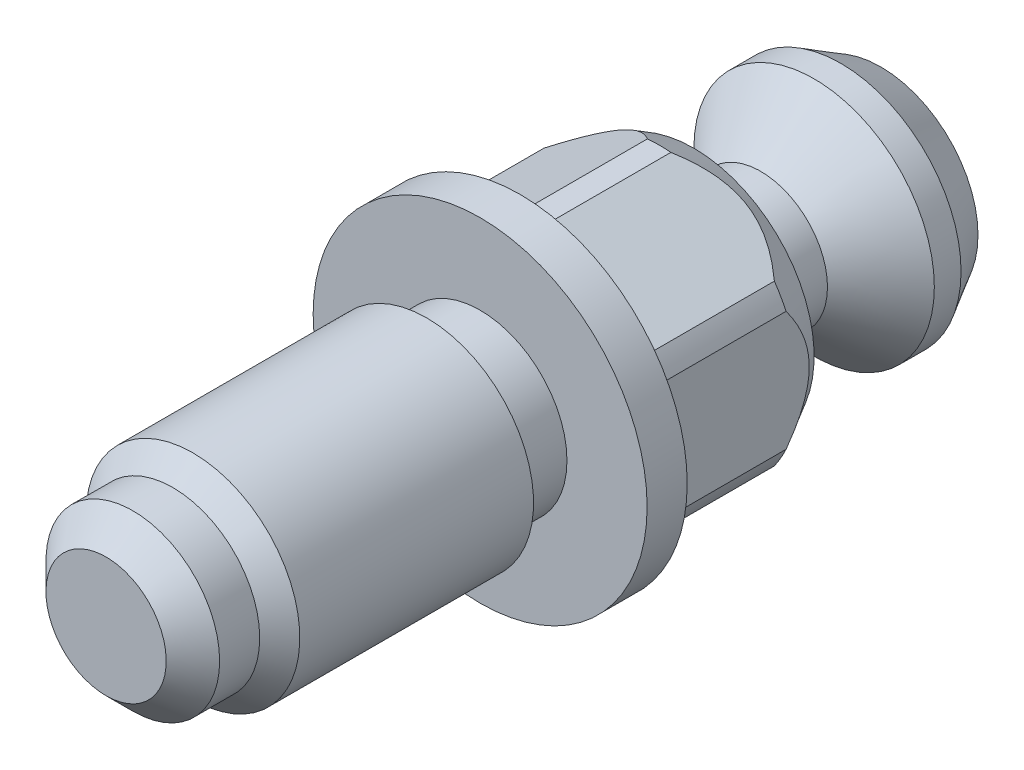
ISO-10303-21;
HEADER;
FILE_DESCRIPTION(('STEP AP214'),'2;1');
FILE_NAME('part.step','',(''),(''),'','','');
FILE_SCHEMA(('AUTOMOTIVE_DESIGN { 1 0 10303 214 1 1 1 1 }'));
ENDSEC;
DATA;
#1=APPLICATION_CONTEXT('core data for automotive mechanical design processes');
#2=APPLICATION_PROTOCOL_DEFINITION('international standard','automotive_design',2000,#1);
#3=PRODUCT_CONTEXT('',#1,'mechanical');
#4=PRODUCT('Part','Part','',(#3));
#5=PRODUCT_RELATED_PRODUCT_CATEGORY('part','',(#4));
#6=PRODUCT_DEFINITION_FORMATION('','',#4);
#7=PRODUCT_DEFINITION_CONTEXT('part definition',#1,'design');
#8=PRODUCT_DEFINITION('design','',#6,#7);
#9=PRODUCT_DEFINITION_SHAPE('','',#8);
#10=(LENGTH_UNIT() NAMED_UNIT(*) SI_UNIT(.MILLI.,.METRE.));
#11=(NAMED_UNIT(*) PLANE_ANGLE_UNIT() SI_UNIT($,.RADIAN.));
#12=(NAMED_UNIT(*) SI_UNIT($,.STERADIAN.) SOLID_ANGLE_UNIT());
#13=UNCERTAINTY_MEASURE_WITH_UNIT(LENGTH_MEASURE(1.E-05),#10,'distance_accuracy_value','');
#14=(GEOMETRIC_REPRESENTATION_CONTEXT(3) GLOBAL_UNCERTAINTY_ASSIGNED_CONTEXT((#13)) GLOBAL_UNIT_ASSIGNED_CONTEXT((#10,
#11,#12)) REPRESENTATION_CONTEXT('',''));
#15=CARTESIAN_POINT('',(0.,0.,0.));
#16=DIRECTION('',(0.,0.,1.));
#17=DIRECTION('',(1.,0.,0.));
#18=AXIS2_PLACEMENT_3D('',#15,#16,#17);
#19=CARTESIAN_POINT('',(0.,7.267949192,-30.));
#20=DIRECTION('',(0.,0.,-1.));
#21=DIRECTION('',(-1.,0.,0.));
#22=AXIS2_PLACEMENT_3D('',#19,#20,#21);
#23=PLANE('',#22);
#24=CARTESIAN_POINT('',(0.,0.,-30.));
#25=DIRECTION('',(0.,0.,1.));
#26=DIRECTION('',(0.,1.,0.));
#27=AXIS2_PLACEMENT_3D('',#24,#25,#26);
#28=CIRCLE('',#27,7.26794919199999);
#29=CARTESIAN_POINT('',(0.,7.26794919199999,-30.));
#30=VERTEX_POINT('',#29);
#31=EDGE_CURVE('E18',#30,#30,#28,.T.);
#32=ORIENTED_EDGE('',*,*,#31,.F.);
#33=EDGE_LOOP('',(#32));
#34=FACE_BOUND('',#33,.T.);
#35=ADVANCED_FACE('F14',(#34),#23,.T.);
#36=CARTESIAN_POINT('',(0.,0.,-27.));
#37=DIRECTION('',(0.,0.,1.));
#38=DIRECTION('',(0.,1.,0.));
#39=AXIS2_PLACEMENT_3D('',#36,#37,#38);
#40=CONICAL_SURFACE('',#39,9.,0.52359877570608);
#41=ORIENTED_EDGE('',*,*,#31,.T.);
#42=EDGE_LOOP('',(#41));
#43=FACE_BOUND('',#42,.T.);
#44=CARTESIAN_POINT('',(0.,0.,-27.));
#45=DIRECTION('',(0.,0.,1.));
#46=DIRECTION('',(1.,0.,0.));
#47=AXIS2_PLACEMENT_3D('',#44,#45,#46);
#48=CIRCLE('',#47,9.);
#49=CARTESIAN_POINT('',(9.,0.,-27.));
#50=VERTEX_POINT('',#49);
#51=EDGE_CURVE('E158',#50,#50,#48,.T.);
#52=ORIENTED_EDGE('',*,*,#51,.F.);
#53=EDGE_LOOP('',(#52));
#54=FACE_BOUND('',#53,.T.);
#55=ADVANCED_FACE('F532',(#43,#54),#40,.T.);
#56=CARTESIAN_POINT('',(0.,0.,-25.));
#57=DIRECTION('',(0.,0.,1.));
#58=DIRECTION('',(1.,0.,0.));
#59=AXIS2_PLACEMENT_3D('',#56,#57,#58);
#60=CYLINDRICAL_SURFACE('',#59,9.);
#61=ORIENTED_EDGE('',*,*,#51,.T.);
#62=EDGE_LOOP('',(#61));
#63=FACE_BOUND('',#62,.T.);
#64=CARTESIAN_POINT('',(0.,0.,-25.));
#65=DIRECTION('',(0.,0.,-1.));
#66=DIRECTION('',(-1.,0.,0.));
#67=AXIS2_PLACEMENT_3D('',#64,#65,#66);
#68=CIRCLE('',#67,9.);
#69=CARTESIAN_POINT('',(-9.,0.,-25.));
#70=VERTEX_POINT('',#69);
#71=EDGE_CURVE('E155',#70,#70,#68,.F.);
#72=ORIENTED_EDGE('',*,*,#71,.F.);
#73=EDGE_LOOP('',(#72));
#74=FACE_BOUND('',#73,.T.);
#75=ADVANCED_FACE('F523',(#63,#74),#60,.T.);
#76=CARTESIAN_POINT('',(0.,0.,-25.));
#77=DIRECTION('',(0.,0.,-1.));
#78=DIRECTION('',(-1.,0.,0.));
#79=AXIS2_PLACEMENT_3D('',#76,#77,#78);
#80=CONICAL_SURFACE('',#79,9.,0.785398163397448);
#81=CARTESIAN_POINT('',(0.,0.,-21.));
#82=DIRECTION('',(0.,0.,1.));
#83=DIRECTION('',(1.,0.,0.));
#84=AXIS2_PLACEMENT_3D('',#81,#82,#83);
#85=CIRCLE('',#84,5.);
#86=CARTESIAN_POINT('',(5.,0.,-21.));
#87=VERTEX_POINT('',#86);
#88=EDGE_CURVE('E151',#87,#87,#85,.T.);
#89=ORIENTED_EDGE('',*,*,#88,.F.);
#90=EDGE_LOOP('',(#89));
#91=FACE_BOUND('',#90,.T.);
#92=ORIENTED_EDGE('',*,*,#71,.T.);
#93=EDGE_LOOP('',(#92));
#94=FACE_BOUND('',#93,.T.);
#95=ADVANCED_FACE('F515',(#91,#94),#80,.T.);
#96=CARTESIAN_POINT('',(0.,0.,-16.));
#97=DIRECTION('',(0.,0.,1.));
#98=DIRECTION('',(1.,0.,0.));
#99=AXIS2_PLACEMENT_3D('',#96,#97,#98);
#100=CYLINDRICAL_SURFACE('',#99,5.);
#101=ORIENTED_EDGE('',*,*,#88,.T.);
#102=EDGE_LOOP('',(#101));
#103=FACE_BOUND('',#102,.T.);
#104=CARTESIAN_POINT('',(0.,0.,-16.));
#105=DIRECTION('',(0.,0.,1.));
#106=DIRECTION('',(1.,0.,0.));
#107=AXIS2_PLACEMENT_3D('',#104,#105,#106);
#108=CIRCLE('',#107,5.);
#109=CARTESIAN_POINT('',(5.,0.,-16.));
#110=VERTEX_POINT('',#109);
#111=EDGE_CURVE('E154',#110,#110,#108,.T.);
#112=ORIENTED_EDGE('',*,*,#111,.F.);
#113=EDGE_LOOP('',(#112));
#114=FACE_BOUND('',#113,.T.);
#115=ADVANCED_FACE('F507',(#103,#114),#100,.T.);
#116=CARTESIAN_POINT('',(0.,10.5,-16.));
#117=DIRECTION('',(0.,0.,-1.));
#118=DIRECTION('',(-1.,0.,0.));
#119=AXIS2_PLACEMENT_3D('',#116,#117,#118);
#120=PLANE('',#119);
#121=ORIENTED_EDGE('',*,*,#111,.T.);
#122=EDGE_LOOP('',(#121));
#123=FACE_BOUND('',#122,.T.);
#124=CARTESIAN_POINT('',(0.,0.,-16.));
#125=DIRECTION('',(0.,0.,1.));
#126=DIRECTION('',(0.,1.,0.));
#127=AXIS2_PLACEMENT_3D('',#124,#125,#126);
#128=CIRCLE('',#127,9.);
#129=CARTESIAN_POINT('',(0.,9.,-16.));
#130=VERTEX_POINT('',#129);
#131=EDGE_CURVE('E113',#130,#130,#128,.T.);
#132=ORIENTED_EDGE('',*,*,#131,.F.);
#133=EDGE_LOOP('',(#132));
#134=FACE_BOUND('',#133,.T.);
#135=ADVANCED_FACE('F222',(#123,#134),#120,.T.);
#136=CARTESIAN_POINT('',(0.,0.,-13.401923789));
#137=DIRECTION('',(0.,0.,1.));
#138=DIRECTION('',(0.,1.,0.));
#139=AXIS2_PLACEMENT_3D('',#136,#137,#138);
#140=CONICAL_SURFACE('',#139,10.5,0.523598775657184);
#141=CARTESIAN_POINT('',(-9.5,4.47213595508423,-13.4019237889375));
#142=CARTESIAN_POINT('',(-9.5,4.37382675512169,-13.4744417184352));
#143=CARTESIAN_POINT('',(-9.5,4.2745898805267,-13.5456985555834));
#144=CARTESIAN_POINT('',(-9.5,4.07411142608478,-13.6853895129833));
#145=CARTESIAN_POINT('',(-9.5,3.97286931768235,-13.753822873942));
#146=CARTESIAN_POINT('',(-9.5,3.66522846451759,-13.9548774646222));
#147=CARTESIAN_POINT('',(-9.50000000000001,3.4556458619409,-14.0827079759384));
#148=CARTESIAN_POINT('',(-9.49999999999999,3.02334222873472,-14.324509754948));
#149=CARTESIAN_POINT('',(-9.49999999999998,2.8004477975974,-14.4381736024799));
#150=CARTESIAN_POINT('',(-9.50000000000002,2.34527205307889,-14.644235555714));
#151=CARTESIAN_POINT('',(-9.50000000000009,2.1130065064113,-14.7366677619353));
#152=CARTESIAN_POINT('',(-9.49999999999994,1.72470446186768,-14.8669939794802));
#153=CARTESIAN_POINT('',(-9.49999999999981,1.57122965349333,-14.9125553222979));
#154=CARTESIAN_POINT('',(-9.50000000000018,1.26118800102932,-14.9917312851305));
#155=CARTESIAN_POINT('',(-9.50000000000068,1.1046210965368,-15.0253456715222));
#156=CARTESIAN_POINT('',(-9.49999999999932,0.790622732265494,-15.0792867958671));
#157=CARTESIAN_POINT('',(-9.49999999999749,0.633211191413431,-15.0997285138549));
#158=CARTESIAN_POINT('',(-9.50000000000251,0.317204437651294,-15.1270741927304));
#159=CARTESIAN_POINT('',(-9.50000000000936,0.158609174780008,-15.1339775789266));
#160=CARTESIAN_POINT('',(-9.50000000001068,-0.185399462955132,-15.1339711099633));
#161=CARTESIAN_POINT('',(-9.50000000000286,-0.370817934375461,-15.1245311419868));
#162=CARTESIAN_POINT('',(-9.49999999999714,-0.73979790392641,-15.0872441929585));
#163=CARTESIAN_POINT('',(-9.49999999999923,-0.923359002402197,-15.059393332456));
#164=CARTESIAN_POINT('',(-9.50000000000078,-1.28889223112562,-14.9862345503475));
#165=CARTESIAN_POINT('',(-9.50000000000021,-1.47082868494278,-14.94075029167));
#166=CARTESIAN_POINT('',(-9.49999999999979,-1.83003894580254,-14.834260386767));
#167=CARTESIAN_POINT('',(-9.49999999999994,-2.00731280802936,-14.7732549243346));
#168=CARTESIAN_POINT('',(-9.50000000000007,-2.38944082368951,-14.625097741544));
#169=CARTESIAN_POINT('',(-9.50000000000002,-2.5932192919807,-14.5351870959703));
#170=CARTESIAN_POINT('',(-9.49999999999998,-2.99324664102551,-14.3397478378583));
#171=CARTESIAN_POINT('',(-9.49999999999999,-3.18948943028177,-14.2342069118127));
#172=CARTESIAN_POINT('',(-9.50000000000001,-3.57066602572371,-14.0127910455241));
#173=CARTESIAN_POINT('',(-9.5,-3.75574854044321,-13.8971694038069));
#174=CARTESIAN_POINT('',(-9.5,-4.11892212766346,-13.6562794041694));
#175=CARTESIAN_POINT('',(-9.49999999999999,-4.29702861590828,-13.5310343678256));
#176=CARTESIAN_POINT('',(-9.5,-4.47213595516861,-13.4019237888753));
#177=B_SPLINE_CURVE_WITH_KNOTS('',3,(#141,#142,#143,#144,#145,#146,#147,#148,#149,#150,#151,
#152,#153,#154,#155,#156,#157,#158,#159,#160,#161,#162,#163,#164,#165,#166,#167,#168,#169,#170,
#171,#172,#173,#174,#175,#176),.UNSPECIFIED.,.F.,.F.,(4,2,2,2,2,2,2,2,2,2,2,2,2,2,2,2,2,4),(0.,
0.36646655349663,0.733031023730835,1.46889072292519,2.21865100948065,2.96719853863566,
3.44707289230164,3.92695662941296,4.40259274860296,4.87824905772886,5.43424731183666,
5.99036276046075,6.55218920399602,7.1140089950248,7.78138203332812,8.44928365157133,
9.10362569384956,9.75642918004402),.UNSPECIFIED.);
#178=CARTESIAN_POINT('',(-9.5,4.4721359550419,-13.4019237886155));
#179=VERTEX_POINT('',#178);
#180=CARTESIAN_POINT('',(-9.5,-4.47213595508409,-13.4019237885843));
#181=VERTEX_POINT('',#180);
#182=EDGE_CURVE('E143',#179,#181,#177,.T.);
#183=ORIENTED_EDGE('',*,*,#182,.F.);
#184=CARTESIAN_POINT('',(0.,0.,-13.4019237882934));
#185=DIRECTION('',(0.,0.,1.));
#186=DIRECTION('',(1.,0.,0.));
#187=AXIS2_PLACEMENT_3D('',#184,#185,#186);
#188=CIRCLE('',#187,10.5);
#189=CARTESIAN_POINT('',(-8.62298334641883,5.99117335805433,-13.4019237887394));
#190=VERTEX_POINT('',#189);
#191=EDGE_CURVE('E144',#190,#179,#188,.T.);
#192=ORIENTED_EDGE('',*,*,#191,.F.);
#193=CARTESIAN_POINT('',(-0.877016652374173,10.463309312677,-13.4019237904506));
#194=CARTESIAN_POINT('',(-0.962161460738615,10.4141509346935,-13.4744472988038));
#195=CARTESIAN_POINT('',(-1.04810979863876,10.3645286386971,-13.5457095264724));
#196=CARTESIAN_POINT('',(-1.22174284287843,10.2642815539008,-13.6854107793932));
#197=CARTESIAN_POINT('',(-1.3094280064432,10.2136565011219,-13.7538490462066));
#198=CARTESIAN_POINT('',(-1.57587049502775,10.0598258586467,-13.9549149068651));
#199=CARTESIAN_POINT('',(-1.75738537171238,9.9550281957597,-14.0827512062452));
#200=CARTESIAN_POINT('',(-2.1317699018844,9.73887718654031,-14.3245462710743));
#201=CARTESIAN_POINT('',(-2.3247886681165,9.62743774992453,-14.4381997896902));
#202=CARTESIAN_POINT('',(-2.7189565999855,9.39986478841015,-14.6442456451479));
#203=CARTESIAN_POINT('',(-2.92009228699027,9.28373904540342,-14.7366716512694));
#204=CARTESIAN_POINT('',(-3.25947795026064,9.08779464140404,-14.868201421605));
#205=CARTESIAN_POINT('',(-3.39558242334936,9.00921468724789,-14.9147138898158));
#206=CARTESIAN_POINT('',(-3.67058705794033,8.8504406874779,-14.9951881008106));
#207=CARTESIAN_POINT('',(-3.80948732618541,8.77024658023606,-15.0291493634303));
#208=CARTESIAN_POINT('',(-4.08805651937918,8.60941458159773,-15.0831094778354));
#209=CARTESIAN_POINT('',(-4.22770769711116,8.5287869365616,-15.1032295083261));
#210=CARTESIAN_POINT('',(-4.50800372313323,8.36695795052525,-15.1292386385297));
#211=CARTESIAN_POINT('',(-4.6486485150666,8.28575664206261,-15.1351285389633));
#212=CARTESIAN_POINT('',(-4.93008837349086,8.12326726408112,-15.1324438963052));
#213=CARTESIAN_POINT('',(-5.07088325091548,8.04197930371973,-15.1238431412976));
#214=CARTESIAN_POINT('',(-5.35127860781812,7.88009296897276,-15.0924656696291));
#215=CARTESIAN_POINT('',(-5.49087901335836,7.79949463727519,-15.0696880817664));
#216=CARTESIAN_POINT('',(-5.76916989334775,7.63882332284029,-15.0105335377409));
#217=CARTESIAN_POINT('',(-5.90784118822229,7.55876141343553,-14.9740372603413));
#218=CARTESIAN_POINT('',(-6.18226449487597,7.40032304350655,-14.8886972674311));
#219=CARTESIAN_POINT('',(-6.31801659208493,7.32194653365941,-14.8398539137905));
#220=CARTESIAN_POINT('',(-6.64960867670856,7.13050175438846,-14.7054936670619));
#221=CARTESIAN_POINT('',(-6.84350226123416,7.01855724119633,-14.6135573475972));
#222=CARTESIAN_POINT('',(-7.22365864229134,6.79907385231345,-14.410233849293));
#223=CARTESIAN_POINT('',(-7.40991048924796,6.69154129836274,-14.2988198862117));
#224=CARTESIAN_POINT('',(-7.77139196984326,6.48283986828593,-14.0627424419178));
#225=CARTESIAN_POINT('',(-7.9467620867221,6.38158988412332,-13.9383635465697));
#226=CARTESIAN_POINT('',(-8.2044002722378,6.23284240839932,-13.7431105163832));
#227=CARTESIAN_POINT('',(-8.28924260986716,6.18385866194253,-13.6766942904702));
#228=CARTESIAN_POINT('',(-8.45730217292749,6.08682942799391,-13.5412207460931));
#229=CARTESIAN_POINT('',(-8.5405197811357,6.03878371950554,-13.472164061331));
#230=CARTESIAN_POINT('',(-8.62298334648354,5.99117335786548,-13.4019237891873));
#231=B_SPLINE_CURVE_WITH_KNOTS('',3,(#193,#194,#195,#196,#197,#198,#199,#200,#201,#202,#203,
#204,#205,#206,#207,#208,#209,#210,#211,#212,#213,#214,#215,#216,#217,#218,#219,#220,#221,#222,
#223,#224,#225,#226,#227,#228,#229,#230),.UNSPECIFIED.,.F.,.F.,(4,2,2,2,2,2,2,2,2,2,2,2,2,2,2,2,
2,2,4),(0.,0.366494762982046,0.733087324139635,1.4689888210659,2.21869243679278,
2.96719859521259,3.45845087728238,3.94972195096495,4.43663529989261,4.9235212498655,
5.41128886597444,5.89908645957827,6.39122881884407,6.88335675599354,7.60823451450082,
8.3341170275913,9.04651481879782,9.40155540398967,9.75651130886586),.UNSPECIFIED.);
#232=CARTESIAN_POINT('',(-0.877016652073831,10.4633093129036,-13.4019237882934));
#233=VERTEX_POINT('',#232);
#234=EDGE_CURVE('E148',#233,#190,#231,.T.);
#235=ORIENTED_EDGE('',*,*,#234,.F.);
#236=CARTESIAN_POINT('',(0.,0.,-13.4019237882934));
#237=DIRECTION('',(0.,0.,1.));
#238=DIRECTION('',(1.,0.,0.));
#239=AXIS2_PLACEMENT_3D('',#236,#237,#238);
#240=CIRCLE('',#239,10.5);
#241=CARTESIAN_POINT('',(0.877016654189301,10.4633093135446,-13.4019237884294));
#242=VERTEX_POINT('',#241);
#243=EDGE_CURVE('E109',#242,#233,#240,.T.);
#244=ORIENTED_EDGE('',*,*,#243,.F.);
#245=CARTESIAN_POINT('',(8.6229833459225,5.99117335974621,-13.4019237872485));
#246=CARTESIAN_POINT('',(8.53783853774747,6.04033173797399,-13.4744472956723));
#247=CARTESIAN_POINT('',(8.45189019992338,6.08995403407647,-13.5457095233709));
#248=CARTESIAN_POINT('',(8.27825715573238,6.19020111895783,-13.6854107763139));
#249=CARTESIAN_POINT('',(8.1905719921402,6.24082617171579,-13.7538490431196));
#250=CARTESIAN_POINT('',(7.92412950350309,6.39465681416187,-13.9549149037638));
#251=CARTESIAN_POINT('',(7.74261462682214,6.49945447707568,-14.0827512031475));
#252=CARTESIAN_POINT('',(7.36823009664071,6.71560548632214,-14.324546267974));
#253=CARTESIAN_POINT('',(7.17521133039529,6.82704492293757,-14.438199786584));
#254=CARTESIAN_POINT('',(6.78104339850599,7.05461788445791,-14.6442456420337));
#255=CARTESIAN_POINT('',(6.5799077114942,7.17074362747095,-14.7366716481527));
#256=CARTESIAN_POINT('',(6.24052204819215,7.36668803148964,-14.8682014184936));
#257=CARTESIAN_POINT('',(6.10441757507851,7.44526798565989,-14.9147138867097));
#258=CARTESIAN_POINT('',(5.82941294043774,7.60404198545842,-14.9951880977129));
#259=CARTESIAN_POINT('',(5.69051267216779,7.6842360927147,-15.0291493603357));
#260=CARTESIAN_POINT('',(5.41194347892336,7.84506809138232,-15.0831094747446));
#261=CARTESIAN_POINT('',(5.2722923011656,7.92569573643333,-15.103229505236));
#262=CARTESIAN_POINT('',(4.99199627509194,8.08752472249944,-15.1292386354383));
#263=CARTESIAN_POINT('',(4.85135148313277,8.16872603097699,-15.13512853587));
#264=CARTESIAN_POINT('',(4.56991162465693,8.33121540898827,-15.1324438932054));
#265=CARTESIAN_POINT('',(4.42911674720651,8.41250336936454,-15.1238431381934));
#266=CARTESIAN_POINT('',(4.14872139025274,8.57438970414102,-15.0924656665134));
#267=CARTESIAN_POINT('',(4.00912098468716,8.65498803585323,-15.0696880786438));
#268=CARTESIAN_POINT('',(3.73083010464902,8.81565935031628,-15.0105335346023));
#269=CARTESIAN_POINT('',(3.59215880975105,8.89572125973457,-14.9740372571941));
#270=CARTESIAN_POINT('',(3.31773550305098,9.05415962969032,-14.8886972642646));
#271=CARTESIAN_POINT('',(3.18198340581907,9.13253613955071,-14.8398539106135));
#272=CARTESIAN_POINT('',(2.85039132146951,9.32398091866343,-14.7054936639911));
#273=CARTESIAN_POINT('',(2.65649773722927,9.43592543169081,-14.6135573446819));
#274=CARTESIAN_POINT('',(2.27634135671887,9.65540882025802,-14.4102338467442));
#275=CARTESIAN_POINT('',(2.09008951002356,9.76294137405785,-14.2988198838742));
#276=CARTESIAN_POINT('',(1.72860802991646,9.9716428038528,-14.0627424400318));
#277=CARTESIAN_POINT('',(1.55323791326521,10.072892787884,-13.9383635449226));
#278=CARTESIAN_POINT('',(1.29559972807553,10.2216402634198,-13.7431105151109));
#279=CARTESIAN_POINT('',(1.2107573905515,10.2706240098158,-13.6766942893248));
#280=CARTESIAN_POINT('',(1.04269782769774,10.3676532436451,-13.5412207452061));
#281=CARTESIAN_POINT('',(0.959480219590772,10.415698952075,-13.4721640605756));
#282=CARTESIAN_POINT('',(0.87701665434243,10.4633093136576,-13.4019237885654));
#283=B_SPLINE_CURVE_WITH_KNOTS('',3,(#245,#246,#247,#248,#249,#250,#251,#252,#253,#254,#255,
#256,#257,#258,#259,#260,#261,#262,#263,#264,#265,#266,#267,#268,#269,#270,#271,#272,#273,#274,
#275,#276,#277,#278,#279,#280,#281,#282),.UNSPECIFIED.,.F.,.F.,(4,2,2,2,2,2,2,2,2,2,2,2,2,2,2,2,
2,2,4),(0.,0.366494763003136,0.733087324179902,1.46898882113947,2.21869243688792,
2.96719859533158,3.45845087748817,3.94972195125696,4.43663530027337,4.92352125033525,
5.41128886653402,5.89908646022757,6.3912288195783,6.88335675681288,7.6082345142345,
8.33411702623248,9.04651481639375,9.40155540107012,9.75651130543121),.UNSPECIFIED.);
#284=CARTESIAN_POINT('',(8.62298334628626,5.99117335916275,-13.4019237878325));
#285=VERTEX_POINT('',#284);
#286=EDGE_CURVE('E102',#285,#242,#283,.T.);
#287=ORIENTED_EDGE('',*,*,#286,.F.);
#288=CARTESIAN_POINT('',(0.,0.,-13.4019237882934));
#289=DIRECTION('',(0.,0.,1.));
#290=DIRECTION('',(1.,0.,0.));
#291=AXIS2_PLACEMENT_3D('',#288,#289,#290);
#292=CIRCLE('',#291,10.5);
#293=CARTESIAN_POINT('',(9.5,4.47213595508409,-13.4019237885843));
#294=VERTEX_POINT('',#293);
#295=EDGE_CURVE('E107',#294,#285,#292,.T.);
#296=ORIENTED_EDGE('',*,*,#295,.F.);
#297=CARTESIAN_POINT('',(9.5,-4.47213595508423,-13.4019237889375));
#298=CARTESIAN_POINT('',(9.5,-4.37382675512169,-13.4744417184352));
#299=CARTESIAN_POINT('',(9.5,-4.2745898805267,-13.5456985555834));
#300=CARTESIAN_POINT('',(9.5,-4.07411142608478,-13.6853895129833));
#301=CARTESIAN_POINT('',(9.5,-3.97286931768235,-13.753822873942));
#302=CARTESIAN_POINT('',(9.5,-3.66522846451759,-13.9548774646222));
#303=CARTESIAN_POINT('',(9.50000000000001,-3.4556458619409,-14.0827079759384));
#304=CARTESIAN_POINT('',(9.49999999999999,-3.02334222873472,-14.324509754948));
#305=CARTESIAN_POINT('',(9.49999999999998,-2.8004477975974,-14.4381736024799));
#306=CARTESIAN_POINT('',(9.50000000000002,-2.34527205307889,-14.644235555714));
#307=CARTESIAN_POINT('',(9.50000000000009,-2.1130065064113,-14.7366677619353));
#308=CARTESIAN_POINT('',(9.49999999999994,-1.72470446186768,-14.8669939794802));
#309=CARTESIAN_POINT('',(9.49999999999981,-1.57122965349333,-14.9125553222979));
#310=CARTESIAN_POINT('',(9.50000000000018,-1.26118800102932,-14.9917312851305));
#311=CARTESIAN_POINT('',(9.50000000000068,-1.1046210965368,-15.0253456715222));
#312=CARTESIAN_POINT('',(9.49999999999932,-0.790622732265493,-15.0792867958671));
#313=CARTESIAN_POINT('',(9.49999999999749,-0.633211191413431,-15.0997285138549));
#314=CARTESIAN_POINT('',(9.50000000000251,-0.317204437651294,-15.1270741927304));
#315=CARTESIAN_POINT('',(9.50000000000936,-0.158609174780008,-15.1339775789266));
#316=CARTESIAN_POINT('',(9.50000000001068,0.185399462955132,-15.1339711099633));
#317=CARTESIAN_POINT('',(9.50000000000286,0.37081793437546,-15.1245311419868));
#318=CARTESIAN_POINT('',(9.49999999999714,0.739797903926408,-15.0872441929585));
#319=CARTESIAN_POINT('',(9.49999999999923,0.923359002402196,-15.059393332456));
#320=CARTESIAN_POINT('',(9.50000000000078,1.28889223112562,-14.9862345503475));
#321=CARTESIAN_POINT('',(9.50000000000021,1.47082868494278,-14.94075029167));
#322=CARTESIAN_POINT('',(9.49999999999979,1.83003894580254,-14.834260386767));
#323=CARTESIAN_POINT('',(9.49999999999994,2.00731280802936,-14.7732549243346));
#324=CARTESIAN_POINT('',(9.50000000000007,2.3894408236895,-14.625097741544));
#325=CARTESIAN_POINT('',(9.50000000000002,2.5932192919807,-14.5351870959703));
#326=CARTESIAN_POINT('',(9.49999999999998,2.99324664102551,-14.3397478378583));
#327=CARTESIAN_POINT('',(9.49999999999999,3.18948943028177,-14.2342069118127));
#328=CARTESIAN_POINT('',(9.50000000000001,3.57066602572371,-14.0127910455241));
#329=CARTESIAN_POINT('',(9.5,3.75574854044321,-13.8971694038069));
#330=CARTESIAN_POINT('',(9.5,4.11892212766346,-13.6562794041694));
#331=CARTESIAN_POINT('',(9.49999999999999,4.29702861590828,-13.5310343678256));
#332=CARTESIAN_POINT('',(9.5,4.47213595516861,-13.4019237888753));
#333=B_SPLINE_CURVE_WITH_KNOTS('',3,(#297,#298,#299,#300,#301,#302,#303,#304,#305,#306,#307,
#308,#309,#310,#311,#312,#313,#314,#315,#316,#317,#318,#319,#320,#321,#322,#323,#324,#325,#326,
#327,#328,#329,#330,#331,#332),.UNSPECIFIED.,.F.,.F.,(4,2,2,2,2,2,2,2,2,2,2,2,2,2,2,2,2,4),(0.,
0.36646655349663,0.733031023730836,1.46889072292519,2.21865100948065,2.96719853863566,
3.44707289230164,3.92695662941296,4.40259274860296,4.87824905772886,5.43424731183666,
5.99036276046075,6.55218920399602,7.11400899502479,7.78138203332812,8.44928365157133,
9.10362569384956,9.75642918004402),.UNSPECIFIED.);
#334=CARTESIAN_POINT('',(9.5,-4.4721359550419,-13.4019237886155));
#335=VERTEX_POINT('',#334);
#336=EDGE_CURVE('E124',#335,#294,#333,.T.);
#337=ORIENTED_EDGE('',*,*,#336,.F.);
#338=CARTESIAN_POINT('',(0.,0.,-13.4019237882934));
#339=DIRECTION('',(0.,0.,1.));
#340=DIRECTION('',(1.,0.,0.));
#341=AXIS2_PLACEMENT_3D('',#338,#339,#340);
#342=CIRCLE('',#341,10.5);
#343=CARTESIAN_POINT('',(8.62298334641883,-5.99117335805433,-13.4019237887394));
#344=VERTEX_POINT('',#343);
#345=EDGE_CURVE('E131',#344,#335,#342,.T.);
#346=ORIENTED_EDGE('',*,*,#345,.F.);
#347=CARTESIAN_POINT('',(0.877016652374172,-10.463309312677,-13.4019237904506));
#348=CARTESIAN_POINT('',(0.962161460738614,-10.4141509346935,-13.4744472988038));
#349=CARTESIAN_POINT('',(1.04810979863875,-10.3645286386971,-13.5457095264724));
#350=CARTESIAN_POINT('',(1.22174284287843,-10.2642815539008,-13.6854107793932));
#351=CARTESIAN_POINT('',(1.3094280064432,-10.2136565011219,-13.7538490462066));
#352=CARTESIAN_POINT('',(1.57587049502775,-10.0598258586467,-13.9549149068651));
#353=CARTESIAN_POINT('',(1.75738537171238,-9.9550281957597,-14.0827512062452));
#354=CARTESIAN_POINT('',(2.1317699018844,-9.73887718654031,-14.3245462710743));
#355=CARTESIAN_POINT('',(2.3247886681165,-9.62743774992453,-14.4381997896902));
#356=CARTESIAN_POINT('',(2.7189565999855,-9.39986478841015,-14.6442456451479));
#357=CARTESIAN_POINT('',(2.92009228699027,-9.28373904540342,-14.7366716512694));
#358=CARTESIAN_POINT('',(3.25947795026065,-9.08779464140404,-14.868201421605));
#359=CARTESIAN_POINT('',(3.39558242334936,-9.00921468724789,-14.9147138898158));
#360=CARTESIAN_POINT('',(3.67058705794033,-8.8504406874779,-14.9951881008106));
#361=CARTESIAN_POINT('',(3.80948732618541,-8.77024658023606,-15.0291493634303));
#362=CARTESIAN_POINT('',(4.08805651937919,-8.60941458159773,-15.0831094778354));
#363=CARTESIAN_POINT('',(4.22770769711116,-8.5287869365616,-15.1032295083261));
#364=CARTESIAN_POINT('',(4.50800372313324,-8.36695795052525,-15.1292386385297));
#365=CARTESIAN_POINT('',(4.64864851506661,-8.28575664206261,-15.1351285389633));
#366=CARTESIAN_POINT('',(4.93008837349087,-8.12326726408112,-15.1324438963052));
#367=CARTESIAN_POINT('',(5.07088325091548,-8.04197930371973,-15.1238431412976));
#368=CARTESIAN_POINT('',(5.35127860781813,-7.88009296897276,-15.0924656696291));
#369=CARTESIAN_POINT('',(5.49087901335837,-7.79949463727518,-15.0696880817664));
#370=CARTESIAN_POINT('',(5.76916989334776,-7.63882332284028,-15.0105335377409));
#371=CARTESIAN_POINT('',(5.9078411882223,-7.55876141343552,-14.9740372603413));
#372=CARTESIAN_POINT('',(6.18226449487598,-7.40032304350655,-14.8886972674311));
#373=CARTESIAN_POINT('',(6.31801659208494,-7.32194653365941,-14.8398539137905));
#374=CARTESIAN_POINT('',(6.64960867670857,-7.13050175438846,-14.7054936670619));
#375=CARTESIAN_POINT('',(6.84350226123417,-7.01855724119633,-14.6135573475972));
#376=CARTESIAN_POINT('',(7.22365864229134,-6.79907385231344,-14.410233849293));
#377=CARTESIAN_POINT('',(7.40991048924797,-6.69154129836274,-14.2988198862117));
#378=CARTESIAN_POINT('',(7.77139196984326,-6.48283986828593,-14.0627424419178));
#379=CARTESIAN_POINT('',(7.9467620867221,-6.38158988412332,-13.9383635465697));
#380=CARTESIAN_POINT('',(8.2044002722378,-6.23284240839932,-13.7431105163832));
#381=CARTESIAN_POINT('',(8.28924260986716,-6.18385866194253,-13.6766942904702));
#382=CARTESIAN_POINT('',(8.45730217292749,-6.0868294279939,-13.5412207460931));
#383=CARTESIAN_POINT('',(8.5405197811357,-6.03878371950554,-13.472164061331));
#384=CARTESIAN_POINT('',(8.62298334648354,-5.99117335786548,-13.4019237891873));
#385=B_SPLINE_CURVE_WITH_KNOTS('',3,(#347,#348,#349,#350,#351,#352,#353,#354,#355,#356,#357,
#358,#359,#360,#361,#362,#363,#364,#365,#366,#367,#368,#369,#370,#371,#372,#373,#374,#375,#376,
#377,#378,#379,#380,#381,#382,#383,#384),.UNSPECIFIED.,.F.,.F.,(4,2,2,2,2,2,2,2,2,2,2,2,2,2,2,2,
2,2,4),(0.,0.366494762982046,0.733087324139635,1.4689888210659,2.21869243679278,
2.96719859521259,3.45845087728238,3.94972195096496,4.43663529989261,4.92352124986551,
5.41128886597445,5.89908645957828,6.39122881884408,6.88335675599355,7.60823451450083,
8.3341170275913,9.04651481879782,9.40155540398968,9.75651130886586),.UNSPECIFIED.);
#386=CARTESIAN_POINT('',(0.877016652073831,-10.4633093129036,-13.4019237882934));
#387=VERTEX_POINT('',#386);
#388=EDGE_CURVE('E135',#387,#344,#385,.T.);
#389=ORIENTED_EDGE('',*,*,#388,.F.);
#390=CARTESIAN_POINT('',(0.,0.,-13.4019237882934));
#391=DIRECTION('',(0.,0.,1.));
#392=DIRECTION('',(1.,0.,0.));
#393=AXIS2_PLACEMENT_3D('',#390,#391,#392);
#394=CIRCLE('',#393,10.5);
#395=CARTESIAN_POINT('',(-0.877016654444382,-10.4633093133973,-13.4019237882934));
#396=VERTEX_POINT('',#395);
#397=EDGE_CURVE('E136',#396,#387,#394,.T.);
#398=ORIENTED_EDGE('',*,*,#397,.F.);
#399=CARTESIAN_POINT('',(-8.62298334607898,-5.99117336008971,-13.4019237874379));
#400=CARTESIAN_POINT('',(-8.53783853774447,-6.04033173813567,-13.4744472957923));
#401=CARTESIAN_POINT('',(-8.45189019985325,-6.08995403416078,-13.5457095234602));
#402=CARTESIAN_POINT('',(-8.27825715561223,-6.19020111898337,-13.6854107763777));
#403=CARTESIAN_POINT('',(-8.19057199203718,-6.24082617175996,-13.7538490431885));
#404=CARTESIAN_POINT('',(-7.92412950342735,-6.39465681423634,-13.9549149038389));
#405=CARTESIAN_POINT('',(-7.74261462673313,-6.49945447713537,-14.0827512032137));
#406=CARTESIAN_POINT('',(-7.36823009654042,-6.71560548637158,-14.3245462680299));
#407=CARTESIAN_POINT('',(-7.17521133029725,-6.82704492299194,-14.4381997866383));
#408=CARTESIAN_POINT('',(-6.78104339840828,-7.05461788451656,-14.6442456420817));
#409=CARTESIAN_POINT('',(-6.5799077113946,-7.17074362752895,-14.7366716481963));
#410=CARTESIAN_POINT('',(-6.24052204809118,-7.36668803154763,-14.8682014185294));
#411=CARTESIAN_POINT('',(-6.10441757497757,-7.44526798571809,-14.9147138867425));
#412=CARTESIAN_POINT('',(-5.82941294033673,-7.60404198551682,-14.9951880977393));
#413=CARTESIAN_POINT('',(-5.69051267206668,-7.6842360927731,-15.0291493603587));
#414=CARTESIAN_POINT('',(-5.41194347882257,-7.84506809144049,-15.0831094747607));
#415=CARTESIAN_POINT('',(-5.27229230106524,-7.92569573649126,-15.1032295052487));
#416=CARTESIAN_POINT('',(-4.99199627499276,-8.08752472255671,-15.1292386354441));
#417=CARTESIAN_POINT('',(-4.85135148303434,-8.16872603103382,-15.1351285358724));
#418=CARTESIAN_POINT('',(-4.56991162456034,-8.33121540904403,-15.1324438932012));
#419=CARTESIAN_POINT('',(-4.42911674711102,-8.41250336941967,-15.1238431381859));
#420=CARTESIAN_POINT('',(-4.14872139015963,-8.57438970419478,-15.0924656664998));
#421=CARTESIAN_POINT('',(-4.00912098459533,-8.65498803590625,-15.0696880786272));
#422=CARTESIAN_POINT('',(-3.7308301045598,-8.81565935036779,-15.0105335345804));
#423=CARTESIAN_POINT('',(-3.59215880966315,-8.89572125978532,-14.9740372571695));
#424=CARTESIAN_POINT('',(-3.31773550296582,-9.05415962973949,-14.8886972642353));
#425=CARTESIAN_POINT('',(-3.18198340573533,-9.13253613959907,-14.8398539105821));
#426=CARTESIAN_POINT('',(-2.85039132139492,-9.3239809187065,-14.7054936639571));
#427=CARTESIAN_POINT('',(-2.65649773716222,-9.43592543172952,-14.6135573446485));
#428=CARTESIAN_POINT('',(-2.27634135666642,-9.65540882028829,-14.4102338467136));
#429=CARTESIAN_POINT('',(-2.09008950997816,-9.76294137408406,-14.298819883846));
#430=CARTESIAN_POINT('',(-1.72860802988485,-9.97164280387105,-14.0627424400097));
#431=CARTESIAN_POINT('',(-1.55323791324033,-10.0728927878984,-13.9383635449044));
#432=CARTESIAN_POINT('',(-1.29559972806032,-10.2216402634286,-13.7431105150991));
#433=CARTESIAN_POINT('',(-1.21075739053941,-10.2706240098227,-13.6766942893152));
#434=CARTESIAN_POINT('',(-1.04269782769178,-10.3676532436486,-13.5412207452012));
#435=CARTESIAN_POINT('',(-0.959480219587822,-10.4156989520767,-13.4721640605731));
#436=CARTESIAN_POINT('',(-0.877016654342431,-10.4633093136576,-13.4019237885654));
#437=B_SPLINE_CURVE_WITH_KNOTS('',3,(#399,#400,#401,#402,#403,#404,#405,#406,#407,#408,#409,
#410,#411,#412,#413,#414,#415,#416,#417,#418,#419,#420,#421,#422,#423,#424,#425,#426,#427,#428,
#429,#430,#431,#432,#433,#434,#435,#436),.UNSPECIFIED.,.F.,.F.,(4,2,2,2,2,2,2,2,2,2,2,2,2,2,2,2,
2,2,4),(0.,0.366494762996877,0.733087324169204,1.46898882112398,2.21869243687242,
2.96719859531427,3.45845087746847,3.94972195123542,4.43663530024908,4.92352125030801,
5.41128886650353,5.89908646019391,6.39122881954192,6.88335675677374,7.60823451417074,
8.33411702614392,9.04651481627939,9.40155540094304,9.75651130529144),.UNSPECIFIED.);
#438=CARTESIAN_POINT('',(-8.62298334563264,-5.99117336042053,-13.4019237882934));
#439=VERTEX_POINT('',#438);
#440=EDGE_CURVE('E139',#439,#396,#437,.T.);
#441=ORIENTED_EDGE('',*,*,#440,.F.);
#442=CARTESIAN_POINT('',(0.,0.,-13.4019237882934));
#443=DIRECTION('',(0.,0.,1.));
#444=DIRECTION('',(1.,0.,0.));
#445=AXIS2_PLACEMENT_3D('',#442,#443,#444);
#446=CIRCLE('',#445,10.5);
#447=EDGE_CURVE('E140',#181,#439,#446,.T.);
#448=ORIENTED_EDGE('',*,*,#447,.F.);
#449=EDGE_LOOP('',(#183,#192,#235,#244,#287,#296,#337,#346,#389,#398,#441,#448));
#450=FACE_BOUND('',#449,.T.);
#451=ORIENTED_EDGE('',*,*,#131,.T.);
#452=EDGE_LOOP('',(#451));
#453=FACE_BOUND('',#452,.T.);
#454=ADVANCED_FACE('F104',(#450,#453),#140,.T.);
#455=CARTESIAN_POINT('',(0.,10.969655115,32.355339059));
#456=DIRECTION('',(0.499999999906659,0.866025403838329,0.));
#457=DIRECTION('',(0.866025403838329,-0.499999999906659,0.));
#458=AXIS2_PLACEMENT_3D('',#455,#456,#457);
#459=PLANE('',#458);
#460=ORIENTED_EDGE('',*,*,#286,.T.);
#461=DIRECTION('',(0.,0.,-1.));
#462=VECTOR('',#461,1.);
#463=CARTESIAN_POINT('',(0.877016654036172,10.4633093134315,-8.2009618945));
#464=LINE('',#463,#462);
#465=CARTESIAN_POINT('',(0.87701665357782,10.46330931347,-3.));
#466=VERTEX_POINT('',#465);
#467=EDGE_CURVE('E112',#466,#242,#464,.T.);
#468=ORIENTED_EDGE('',*,*,#467,.F.);
#469=DIRECTION('',(-0.866025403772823,0.500000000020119,0.));
#470=VECTOR('',#469,1.);
#471=CARTESIAN_POINT('',(8.622983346,5.991173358,-3.));
#472=LINE('',#471,#470);
#473=CARTESIAN_POINT('',(8.62298334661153,5.99117335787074,-3.));
#474=VERTEX_POINT('',#473);
#475=EDGE_CURVE('E119',#474,#466,#472,.T.);
#476=ORIENTED_EDGE('',*,*,#475,.F.);
#477=DIRECTION('',(0.,0.,1.));
#478=VECTOR('',#477,1.);
#479=CARTESIAN_POINT('',(8.62298334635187,5.99117335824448,-8.2009618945));
#480=LINE('',#479,#478);
#481=EDGE_CURVE('E116',#285,#474,#480,.T.);
#482=ORIENTED_EDGE('',*,*,#481,.F.);
#483=EDGE_LOOP('',(#460,#468,#476,#482));
#484=FACE_BOUND('',#483,.T.);
#485=ADVANCED_FACE('F117',(#484),#459,.T.);
#486=CARTESIAN_POINT('',(0.,0.,-3.));
#487=DIRECTION('',(0.,0.,1.));
#488=DIRECTION('',(1.,0.,0.));
#489=AXIS2_PLACEMENT_3D('',#486,#487,#488);
#490=CYLINDRICAL_SURFACE('',#489,10.5);
#491=ORIENTED_EDGE('',*,*,#243,.T.);
#492=DIRECTION('',(0.,0.,-1.));
#493=VECTOR('',#492,1.);
#494=CARTESIAN_POINT('',(-0.877016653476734,10.4633093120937,32.355339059));
#495=LINE('',#494,#493);
#496=CARTESIAN_POINT('',(-0.877016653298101,10.463309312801,-3.));
#497=VERTEX_POINT('',#496);
#498=EDGE_CURVE('E150',#497,#233,#495,.T.);
#499=ORIENTED_EDGE('',*,*,#498,.F.);
#500=CARTESIAN_POINT('',(0.,0.,-3.));
#501=DIRECTION('',(0.,0.,1.));
#502=DIRECTION('',(1.,0.,0.));
#503=AXIS2_PLACEMENT_3D('',#500,#501,#502);
#504=CIRCLE('',#503,10.5);
#505=EDGE_CURVE('E199',#466,#497,#504,.T.);
#506=ORIENTED_EDGE('',*,*,#505,.F.);
#507=ORIENTED_EDGE('',*,*,#467,.T.);
#508=EDGE_LOOP('',(#491,#499,#506,#507));
#509=FACE_BOUND('',#508,.T.);
#510=ADVANCED_FACE('F481',(#509),#490,.T.);
#511=CARTESIAN_POINT('',(-9.5,5.484827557,32.355339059));
#512=DIRECTION('',(-0.499999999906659,0.866025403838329,0.));
#513=DIRECTION('',(0.866025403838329,0.499999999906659,0.));
#514=AXIS2_PLACEMENT_3D('',#511,#512,#513);
#515=PLANE('',#514);
#516=ORIENTED_EDGE('',*,*,#234,.T.);
#517=DIRECTION('',(0.,0.,-1.));
#518=VECTOR('',#517,1.);
#519=CARTESIAN_POINT('',(-8.62298334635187,5.99117335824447,-8.2009618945));
#520=LINE('',#519,#518);
#521=CARTESIAN_POINT('',(-8.62298334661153,5.99117335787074,-3.));
#522=VERTEX_POINT('',#521);
#523=EDGE_CURVE('E147',#522,#190,#520,.T.);
#524=ORIENTED_EDGE('',*,*,#523,.F.);
#525=DIRECTION('',(-0.866025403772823,-0.500000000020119,0.));
#526=VECTOR('',#525,1.);
#527=CARTESIAN_POINT('',(-0.877016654,10.463309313,-3.));
#528=LINE('',#527,#526);
#529=EDGE_CURVE('E198',#497,#522,#528,.T.);
#530=ORIENTED_EDGE('',*,*,#529,.F.);
#531=ORIENTED_EDGE('',*,*,#498,.T.);
#532=EDGE_LOOP('',(#516,#524,#530,#531));
#533=FACE_BOUND('',#532,.T.);
#534=ADVANCED_FACE('F474',(#533),#515,.T.);
#535=CARTESIAN_POINT('',(0.,0.,-3.));
#536=DIRECTION('',(0.,0.,1.));
#537=DIRECTION('',(1.,0.,0.));
#538=AXIS2_PLACEMENT_3D('',#535,#536,#537);
#539=CYLINDRICAL_SURFACE('',#538,10.5);
#540=CARTESIAN_POINT('',(0.,0.,-3.));
#541=DIRECTION('',(0.,0.,1.));
#542=DIRECTION('',(1.,0.,0.));
#543=AXIS2_PLACEMENT_3D('',#540,#541,#542);
#544=CIRCLE('',#543,10.5);
#545=CARTESIAN_POINT('',(-9.5,4.47213595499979,-3.));
#546=VERTEX_POINT('',#545);
#547=EDGE_CURVE('E195',#522,#546,#544,.T.);
#548=ORIENTED_EDGE('',*,*,#547,.F.);
#549=ORIENTED_EDGE('',*,*,#523,.T.);
#550=ORIENTED_EDGE('',*,*,#191,.T.);
#551=DIRECTION('',(0.,0.,1.));
#552=VECTOR('',#551,1.);
#553=CARTESIAN_POINT('',(-9.5,4.472135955,32.355339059));
#554=LINE('',#553,#552);
#555=EDGE_CURVE('E249',#546,#179,#554,.F.);
#556=ORIENTED_EDGE('',*,*,#555,.F.);
#557=EDGE_LOOP('',(#548,#549,#550,#556));
#558=FACE_BOUND('',#557,.T.);
#559=ADVANCED_FACE('F261',(#558),#539,.T.);
#560=CARTESIAN_POINT('',(-9.5,-5.484827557,32.355339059));
#561=DIRECTION('',(-1.,0.,0.));
#562=DIRECTION('',(0.,0.,1.));
#563=AXIS2_PLACEMENT_3D('',#560,#561,#562);
#564=PLANE('',#563);
#565=ORIENTED_EDGE('',*,*,#182,.T.);
#566=DIRECTION('',(0.,0.,-1.));
#567=VECTOR('',#566,1.);
#568=CARTESIAN_POINT('',(-9.49999999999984,-4.47213595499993,-8.2009618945));
#569=LINE('',#568,#567);
#570=CARTESIAN_POINT('',(-9.5,-4.47213595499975,-3.));
#571=VERTEX_POINT('',#570);
#572=EDGE_CURVE('E142',#571,#181,#569,.T.);
#573=ORIENTED_EDGE('',*,*,#572,.F.);
#574=DIRECTION('',(0.,1.,0.));
#575=VECTOR('',#574,1.);
#576=CARTESIAN_POINT('',(-9.5,12.5,-3.));
#577=LINE('',#576,#575);
#578=EDGE_CURVE('E194',#546,#571,#577,.F.);
#579=ORIENTED_EDGE('',*,*,#578,.F.);
#580=ORIENTED_EDGE('',*,*,#555,.T.);
#581=EDGE_LOOP('',(#565,#573,#579,#580));
#582=FACE_BOUND('',#581,.T.);
#583=ADVANCED_FACE('F255',(#582),#564,.T.);
#584=CARTESIAN_POINT('',(0.,0.,-3.));
#585=DIRECTION('',(0.,0.,1.));
#586=DIRECTION('',(1.,0.,0.));
#587=AXIS2_PLACEMENT_3D('',#584,#585,#586);
#588=CYLINDRICAL_SURFACE('',#587,10.5);
#589=CARTESIAN_POINT('',(0.,0.,-3.));
#590=DIRECTION('',(0.,0.,1.));
#591=DIRECTION('',(1.,0.,0.));
#592=AXIS2_PLACEMENT_3D('',#589,#590,#591);
#593=CIRCLE('',#592,10.5);
#594=CARTESIAN_POINT('',(-8.62298334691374,-5.99117335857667,-3.));
#595=VERTEX_POINT('',#594);
#596=EDGE_CURVE('E191',#571,#595,#593,.T.);
#597=ORIENTED_EDGE('',*,*,#596,.F.);
#598=ORIENTED_EDGE('',*,*,#572,.T.);
#599=ORIENTED_EDGE('',*,*,#447,.T.);
#600=DIRECTION('',(0.,0.,-1.));
#601=VECTOR('',#600,1.);
#602=CARTESIAN_POINT('',(-8.62298334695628,-5.99117335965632,32.355339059));
#603=LINE('',#602,#601);
#604=EDGE_CURVE('E308',#595,#439,#603,.T.);
#605=ORIENTED_EDGE('',*,*,#604,.F.);
#606=EDGE_LOOP('',(#597,#598,#599,#605));
#607=FACE_BOUND('',#606,.T.);
#608=ADVANCED_FACE('F260',(#607),#588,.T.);
#609=CARTESIAN_POINT('',(0.,-10.969655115,32.355339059));
#610=DIRECTION('',(-0.499999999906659,-0.866025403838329,0.));
#611=DIRECTION('',(-0.866025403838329,0.499999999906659,0.));
#612=AXIS2_PLACEMENT_3D('',#609,#610,#611);
#613=PLANE('',#612);
#614=ORIENTED_EDGE('',*,*,#440,.T.);
#615=DIRECTION('',(0.,0.,-1.));
#616=VECTOR('',#615,1.);
#617=CARTESIAN_POINT('',(-0.877016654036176,-10.4633093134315,-8.2009618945));
#618=LINE('',#617,#616);
#619=CARTESIAN_POINT('',(-0.877016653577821,-10.46330931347,-3.));
#620=VERTEX_POINT('',#619);
#621=EDGE_CURVE('E138',#620,#396,#618,.T.);
#622=ORIENTED_EDGE('',*,*,#621,.F.);
#623=DIRECTION('',(0.866025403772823,-0.500000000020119,0.));
#624=VECTOR('',#623,1.);
#625=CARTESIAN_POINT('',(-8.622983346,-5.991173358,-3.));
#626=LINE('',#625,#624);
#627=EDGE_CURVE('E190',#595,#620,#626,.T.);
#628=ORIENTED_EDGE('',*,*,#627,.F.);
#629=ORIENTED_EDGE('',*,*,#604,.T.);
#630=EDGE_LOOP('',(#614,#622,#628,#629));
#631=FACE_BOUND('',#630,.T.);
#632=ADVANCED_FACE('F264',(#631),#613,.T.);
#633=CARTESIAN_POINT('',(0.,0.,-3.));
#634=DIRECTION('',(0.,0.,1.));
#635=DIRECTION('',(1.,0.,0.));
#636=AXIS2_PLACEMENT_3D('',#633,#634,#635);
#637=CYLINDRICAL_SURFACE('',#636,10.5);
#638=CARTESIAN_POINT('',(0.,0.,-3.));
#639=DIRECTION('',(0.,0.,1.));
#640=DIRECTION('',(1.,0.,0.));
#641=AXIS2_PLACEMENT_3D('',#638,#639,#640);
#642=CIRCLE('',#641,10.5);
#643=CARTESIAN_POINT('',(0.877016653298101,-10.463309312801,-3.));
#644=VERTEX_POINT('',#643);
#645=EDGE_CURVE('E187',#620,#644,#642,.T.);
#646=ORIENTED_EDGE('',*,*,#645,.F.);
#647=ORIENTED_EDGE('',*,*,#621,.T.);
#648=ORIENTED_EDGE('',*,*,#397,.T.);
#649=DIRECTION('',(0.,0.,-1.));
#650=VECTOR('',#649,1.);
#651=CARTESIAN_POINT('',(0.877016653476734,-10.4633093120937,32.355339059));
#652=LINE('',#651,#650);
#653=EDGE_CURVE('E306',#644,#387,#652,.T.);
#654=ORIENTED_EDGE('',*,*,#653,.F.);
#655=EDGE_LOOP('',(#646,#647,#648,#654));
#656=FACE_BOUND('',#655,.T.);
#657=ADVANCED_FACE('F269',(#656),#637,.T.);
#658=CARTESIAN_POINT('',(9.5,-5.484827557,32.355339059));
#659=DIRECTION('',(0.499999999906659,-0.866025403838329,0.));
#660=DIRECTION('',(-0.866025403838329,-0.499999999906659,0.));
#661=AXIS2_PLACEMENT_3D('',#658,#659,#660);
#662=PLANE('',#661);
#663=ORIENTED_EDGE('',*,*,#388,.T.);
#664=DIRECTION('',(0.,0.,-1.));
#665=VECTOR('',#664,1.);
#666=CARTESIAN_POINT('',(8.62298334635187,-5.99117335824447,-8.2009618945));
#667=LINE('',#666,#665);
#668=CARTESIAN_POINT('',(8.62298334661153,-5.99117335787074,-3.));
#669=VERTEX_POINT('',#668);
#670=EDGE_CURVE('E134',#669,#344,#667,.T.);
#671=ORIENTED_EDGE('',*,*,#670,.F.);
#672=DIRECTION('',(0.866025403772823,0.500000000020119,0.));
#673=VECTOR('',#672,1.);
#674=CARTESIAN_POINT('',(0.877016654,-10.463309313,-3.));
#675=LINE('',#674,#673);
#676=EDGE_CURVE('E186',#644,#669,#675,.T.);
#677=ORIENTED_EDGE('',*,*,#676,.F.);
#678=ORIENTED_EDGE('',*,*,#653,.T.);
#679=EDGE_LOOP('',(#663,#671,#677,#678));
#680=FACE_BOUND('',#679,.T.);
#681=ADVANCED_FACE('F272',(#680),#662,.T.);
#682=CARTESIAN_POINT('',(0.,0.,-3.));
#683=DIRECTION('',(0.,0.,1.));
#684=DIRECTION('',(1.,0.,0.));
#685=AXIS2_PLACEMENT_3D('',#682,#683,#684);
#686=CYLINDRICAL_SURFACE('',#685,10.5);
#687=CARTESIAN_POINT('',(0.,0.,-3.));
#688=DIRECTION('',(0.,0.,1.));
#689=DIRECTION('',(1.,0.,0.));
#690=AXIS2_PLACEMENT_3D('',#687,#688,#689);
#691=CIRCLE('',#690,10.5);
#692=CARTESIAN_POINT('',(9.5,-4.47213595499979,-3.));
#693=VERTEX_POINT('',#692);
#694=EDGE_CURVE('E183',#669,#693,#691,.T.);
#695=ORIENTED_EDGE('',*,*,#694,.F.);
#696=ORIENTED_EDGE('',*,*,#670,.T.);
#697=ORIENTED_EDGE('',*,*,#345,.T.);
#698=DIRECTION('',(0.,0.,-1.));
#699=VECTOR('',#698,1.);
#700=CARTESIAN_POINT('',(9.5,-4.472135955,32.355339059));
#701=LINE('',#700,#699);
#702=EDGE_CURVE('E126',#693,#335,#701,.T.);
#703=ORIENTED_EDGE('',*,*,#702,.F.);
#704=EDGE_LOOP('',(#695,#696,#697,#703));
#705=FACE_BOUND('',#704,.T.);
#706=ADVANCED_FACE('F276',(#705),#686,.T.);
#707=CARTESIAN_POINT('',(9.5,5.484827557,32.355339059));
#708=DIRECTION('',(1.,0.,0.));
#709=DIRECTION('',(0.,0.,-1.));
#710=AXIS2_PLACEMENT_3D('',#707,#708,#709);
#711=PLANE('',#710);
#712=ORIENTED_EDGE('',*,*,#336,.T.);
#713=DIRECTION('',(0.,0.,-1.));
#714=VECTOR('',#713,1.);
#715=CARTESIAN_POINT('',(9.49999999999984,4.47213595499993,-8.2009618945));
#716=LINE('',#715,#714);
#717=CARTESIAN_POINT('',(9.5,4.47213595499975,-3.));
#718=VERTEX_POINT('',#717);
#719=EDGE_CURVE('E33',#718,#294,#716,.T.);
#720=ORIENTED_EDGE('',*,*,#719,.F.);
#721=DIRECTION('',(0.,1.,0.));
#722=VECTOR('',#721,1.);
#723=CARTESIAN_POINT('',(9.5,12.5,-3.));
#724=LINE('',#723,#722);
#725=EDGE_CURVE('E182',#693,#718,#724,.T.);
#726=ORIENTED_EDGE('',*,*,#725,.F.);
#727=ORIENTED_EDGE('',*,*,#702,.T.);
#728=EDGE_LOOP('',(#712,#720,#726,#727));
#729=FACE_BOUND('',#728,.T.);
#730=ADVANCED_FACE('F214',(#729),#711,.T.);
#731=CARTESIAN_POINT('',(0.,0.,-3.));
#732=DIRECTION('',(0.,0.,1.));
#733=DIRECTION('',(1.,0.,0.));
#734=AXIS2_PLACEMENT_3D('',#731,#732,#733);
#735=CYLINDRICAL_SURFACE('',#734,10.5);
#736=CARTESIAN_POINT('',(0.,0.,-3.));
#737=DIRECTION('',(0.,0.,1.));
#738=DIRECTION('',(1.,0.,0.));
#739=AXIS2_PLACEMENT_3D('',#736,#737,#738);
#740=CIRCLE('',#739,10.5);
#741=EDGE_CURVE('E180',#718,#474,#740,.T.);
#742=ORIENTED_EDGE('',*,*,#741,.F.);
#743=ORIENTED_EDGE('',*,*,#719,.T.);
#744=ORIENTED_EDGE('',*,*,#295,.T.);
#745=ORIENTED_EDGE('',*,*,#481,.T.);
#746=EDGE_LOOP('',(#742,#743,#744,#745));
#747=FACE_BOUND('',#746,.T.);
#748=ADVANCED_FACE('F123',(#747),#735,.T.);
#749=CARTESIAN_POINT('',(0.,12.5,-3.));
#750=DIRECTION('',(0.,0.,-1.));
#751=DIRECTION('',(-1.,0.,0.));
#752=AXIS2_PLACEMENT_3D('',#749,#750,#751);
#753=PLANE('',#752);
#754=ORIENTED_EDGE('',*,*,#725,.T.);
#755=ORIENTED_EDGE('',*,*,#741,.T.);
#756=ORIENTED_EDGE('',*,*,#475,.T.);
#757=ORIENTED_EDGE('',*,*,#505,.T.);
#758=ORIENTED_EDGE('',*,*,#529,.T.);
#759=ORIENTED_EDGE('',*,*,#547,.T.);
#760=ORIENTED_EDGE('',*,*,#578,.T.);
#761=ORIENTED_EDGE('',*,*,#596,.T.);
#762=ORIENTED_EDGE('',*,*,#627,.T.);
#763=ORIENTED_EDGE('',*,*,#645,.T.);
#764=ORIENTED_EDGE('',*,*,#676,.T.);
#765=ORIENTED_EDGE('',*,*,#694,.T.);
#766=EDGE_LOOP('',(#754,#755,#756,#757,#758,#759,#760,#761,#762,#763,#764,#765));
#767=FACE_BOUND('',#766,.T.);
#768=CARTESIAN_POINT('',(0.,0.,-3.));
#769=DIRECTION('',(0.,0.,1.));
#770=DIRECTION('',(1.,0.,0.));
#771=AXIS2_PLACEMENT_3D('',#768,#769,#770);
#772=CIRCLE('',#771,12.5);
#773=CARTESIAN_POINT('',(12.5,0.,-3.));
#774=VERTEX_POINT('',#773);
#775=EDGE_CURVE('E177',#774,#774,#772,.T.);
#776=ORIENTED_EDGE('',*,*,#775,.F.);
#777=EDGE_LOOP('',(#776));
#778=FACE_BOUND('',#777,.T.);
#779=ADVANCED_FACE('F418',(#767,#778),#753,.T.);
#780=CARTESIAN_POINT('',(0.,0.,0.));
#781=DIRECTION('',(0.,0.,1.));
#782=DIRECTION('',(1.,0.,0.));
#783=AXIS2_PLACEMENT_3D('',#780,#781,#782);
#784=CYLINDRICAL_SURFACE('',#783,12.5);
#785=ORIENTED_EDGE('',*,*,#775,.T.);
#786=EDGE_LOOP('',(#785));
#787=FACE_BOUND('',#786,.T.);
#788=CARTESIAN_POINT('',(0.,0.,0.));
#789=DIRECTION('',(0.,0.,1.));
#790=DIRECTION('',(1.,0.,0.));
#791=AXIS2_PLACEMENT_3D('',#788,#789,#790);
#792=CIRCLE('',#791,12.5);
#793=CARTESIAN_POINT('',(12.5,0.,0.));
#794=VERTEX_POINT('',#793);
#795=EDGE_CURVE('E174',#794,#794,#792,.T.);
#796=ORIENTED_EDGE('',*,*,#795,.F.);
#797=EDGE_LOOP('',(#796));
#798=FACE_BOUND('',#797,.T.);
#799=ADVANCED_FACE('F355',(#787,#798),#784,.T.);
#800=CARTESIAN_POINT('',(0.,6.5,0.));
#801=DIRECTION('',(0.,0.,1.));
#802=DIRECTION('',(1.,0.,0.));
#803=AXIS2_PLACEMENT_3D('',#800,#801,#802);
#804=PLANE('',#803);
#805=CARTESIAN_POINT('',(0.,0.,0.));
#806=DIRECTION('',(0.,0.,1.));
#807=DIRECTION('',(1.,0.,0.));
#808=AXIS2_PLACEMENT_3D('',#805,#806,#807);
#809=CIRCLE('',#808,6.5);
#810=CARTESIAN_POINT('',(6.5,0.,0.));
#811=VERTEX_POINT('',#810);
#812=EDGE_CURVE('E171',#811,#811,#809,.T.);
#813=ORIENTED_EDGE('',*,*,#812,.F.);
#814=EDGE_LOOP('',(#813));
#815=FACE_BOUND('',#814,.T.);
#816=ORIENTED_EDGE('',*,*,#795,.T.);
#817=EDGE_LOOP('',(#816));
#818=FACE_BOUND('',#817,.T.);
#819=ADVANCED_FACE('F347',(#815,#818),#804,.T.);
#820=CARTESIAN_POINT('',(0.,6.5,28.));
#821=DIRECTION('',(0.,0.,1.));
#822=DIRECTION('',(1.,0.,0.));
#823=AXIS2_PLACEMENT_3D('',#820,#821,#822);
#824=PLANE('',#823);
#825=CARTESIAN_POINT('',(0.,0.,28.));
#826=DIRECTION('',(0.,0.,-1.));
#827=DIRECTION('',(0.,-1.,0.));
#828=AXIS2_PLACEMENT_3D('',#825,#826,#827);
#829=CIRCLE('',#828,4.5);
#830=CARTESIAN_POINT('',(0.,-4.5,28.));
#831=VERTEX_POINT('',#830);
#832=EDGE_CURVE('E168',#831,#831,#829,.T.);
#833=ORIENTED_EDGE('',*,*,#832,.F.);
#834=EDGE_LOOP('',(#833));
#835=FACE_BOUND('',#834,.T.);
#836=ADVANCED_FACE('F345',(#835),#824,.T.);
#837=CARTESIAN_POINT('',(0.,0.,4.));
#838=DIRECTION('',(0.,0.,1.));
#839=DIRECTION('',(1.,0.,0.));
#840=AXIS2_PLACEMENT_3D('',#837,#838,#839);
#841=CYLINDRICAL_SURFACE('',#840,6.5);
#842=ORIENTED_EDGE('',*,*,#812,.T.);
#843=EDGE_LOOP('',(#842));
#844=FACE_BOUND('',#843,.T.);
#845=CARTESIAN_POINT('',(0.,0.,4.));
#846=DIRECTION('',(0.,0.,1.));
#847=DIRECTION('',(1.,0.,0.));
#848=AXIS2_PLACEMENT_3D('',#845,#846,#847);
#849=CIRCLE('',#848,6.5);
#850=CARTESIAN_POINT('',(6.5,0.,4.));
#851=VERTEX_POINT('',#850);
#852=EDGE_CURVE('E165',#851,#851,#849,.T.);
#853=ORIENTED_EDGE('',*,*,#852,.F.);
#854=EDGE_LOOP('',(#853));
#855=FACE_BOUND('',#854,.T.);
#856=ADVANCED_FACE('F341',(#844,#855),#841,.T.);
#857=CARTESIAN_POINT('',(0.,0.,26.));
#858=DIRECTION('',(0.,0.,-1.));
#859=DIRECTION('',(0.,-1.,0.));
#860=AXIS2_PLACEMENT_3D('',#857,#858,#859);
#861=CONICAL_SURFACE('',#860,6.5,0.785398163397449);
#862=CARTESIAN_POINT('',(0.,0.,26.));
#863=DIRECTION('',(0.,0.,1.));
#864=DIRECTION('',(1.,0.,0.));
#865=AXIS2_PLACEMENT_3D('',#862,#863,#864);
#866=CIRCLE('',#865,6.5);
#867=CARTESIAN_POINT('',(6.5,0.,26.));
#868=VERTEX_POINT('',#867);
#869=EDGE_CURVE('E164',#868,#868,#866,.F.);
#870=ORIENTED_EDGE('',*,*,#869,.F.);
#871=EDGE_LOOP('',(#870));
#872=FACE_BOUND('',#871,.T.);
#873=ORIENTED_EDGE('',*,*,#832,.T.);
#874=EDGE_LOOP('',(#873));
#875=FACE_BOUND('',#874,.T.);
#876=ADVANCED_FACE('F337',(#872,#875),#861,.T.);
#877=CARTESIAN_POINT('',(0.,6.5,4.));
#878=DIRECTION('',(0.,0.,-1.));
#879=DIRECTION('',(-1.,0.,0.));
#880=AXIS2_PLACEMENT_3D('',#877,#878,#879);
#881=PLANE('',#880);
#882=ORIENTED_EDGE('',*,*,#852,.T.);
#883=EDGE_LOOP('',(#882));
#884=FACE_BOUND('',#883,.T.);
#885=CARTESIAN_POINT('',(0.,0.,4.));
#886=DIRECTION('',(0.,0.,1.));
#887=DIRECTION('',(0.,1.,0.));
#888=AXIS2_PLACEMENT_3D('',#885,#886,#887);
#889=CIRCLE('',#888,8.);
#890=CARTESIAN_POINT('',(0.,8.,4.));
#891=VERTEX_POINT('',#890);
#892=EDGE_CURVE('E161',#891,#891,#889,.T.);
#893=ORIENTED_EDGE('',*,*,#892,.F.);
#894=EDGE_LOOP('',(#893));
#895=FACE_BOUND('',#894,.T.);
#896=ADVANCED_FACE('F340',(#884,#895),#881,.T.);
#897=CARTESIAN_POINT('',(0.,0.,26.));
#898=DIRECTION('',(0.,0.,1.));
#899=DIRECTION('',(0.,1.,0.));
#900=AXIS2_PLACEMENT_3D('',#897,#898,#899);
#901=CYLINDRICAL_SURFACE('',#900,6.5);
#902=ORIENTED_EDGE('',*,*,#869,.T.);
#903=EDGE_LOOP('',(#902));
#904=FACE_BOUND('',#903,.T.);
#905=CARTESIAN_POINT('',(0.,0.,23.));
#906=DIRECTION('',(0.,0.,-1.));
#907=DIRECTION('',(-1.,0.,0.));
#908=AXIS2_PLACEMENT_3D('',#905,#906,#907);
#909=CIRCLE('',#908,6.5);
#910=CARTESIAN_POINT('',(-6.5,0.,23.0000000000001));
#911=VERTEX_POINT('',#910);
#912=EDGE_CURVE('E24',#911,#911,#909,.T.);
#913=ORIENTED_EDGE('',*,*,#912,.F.);
#914=EDGE_LOOP('',(#913));
#915=FACE_BOUND('',#914,.T.);
#916=ADVANCED_FACE('F291',(#904,#915),#901,.T.);
#917=CARTESIAN_POINT('',(0.,0.,21.5));
#918=DIRECTION('',(0.,0.,1.));
#919=DIRECTION('',(0.,1.,0.));
#920=AXIS2_PLACEMENT_3D('',#917,#918,#919);
#921=CYLINDRICAL_SURFACE('',#920,8.);
#922=CARTESIAN_POINT('',(0.,0.,21.5));
#923=DIRECTION('',(0.,0.,-1.));
#924=DIRECTION('',(-1.,0.,0.));
#925=AXIS2_PLACEMENT_3D('',#922,#923,#924);
#926=CIRCLE('',#925,8.);
#927=CARTESIAN_POINT('',(-8.,0.,21.4999999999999));
#928=VERTEX_POINT('',#927);
#929=EDGE_CURVE('E9',#928,#928,#926,.F.);
#930=ORIENTED_EDGE('',*,*,#929,.F.);
#931=EDGE_LOOP('',(#930));
#932=FACE_BOUND('',#931,.T.);
#933=ORIENTED_EDGE('',*,*,#892,.T.);
#934=EDGE_LOOP('',(#933));
#935=FACE_BOUND('',#934,.T.);
#936=ADVANCED_FACE('F286',(#932,#935),#921,.T.);
#937=CARTESIAN_POINT('',(0.,0.,21.5));
#938=DIRECTION('',(0.,0.,-1.));
#939=DIRECTION('',(0.,-1.,0.));
#940=AXIS2_PLACEMENT_3D('',#937,#938,#939);
#941=CONICAL_SURFACE('',#940,8.,0.785398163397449);
#942=ORIENTED_EDGE('',*,*,#929,.T.);
#943=EDGE_LOOP('',(#942));
#944=FACE_BOUND('',#943,.T.);
#945=ORIENTED_EDGE('',*,*,#912,.T.);
#946=EDGE_LOOP('',(#945));
#947=FACE_BOUND('',#946,.T.);
#948=ADVANCED_FACE('F16',(#944,#947),#941,.T.);
#949=CLOSED_SHELL('',(#35,#55,#75,#95,#115,#135,#454,#485,#510,#534,#559,#583,#608,#632,#657,
#681,#706,#730,#748,#779,#799,#819,#836,#856,#876,#896,#916,#936,#948));
#950=MANIFOLD_SOLID_BREP('B1',#949);
#951=ADVANCED_BREP_SHAPE_REPRESENTATION('',(#18,#950),#14);
#952=SHAPE_DEFINITION_REPRESENTATION(#9,#951);
ENDSEC;
END-ISO-10303-21;
